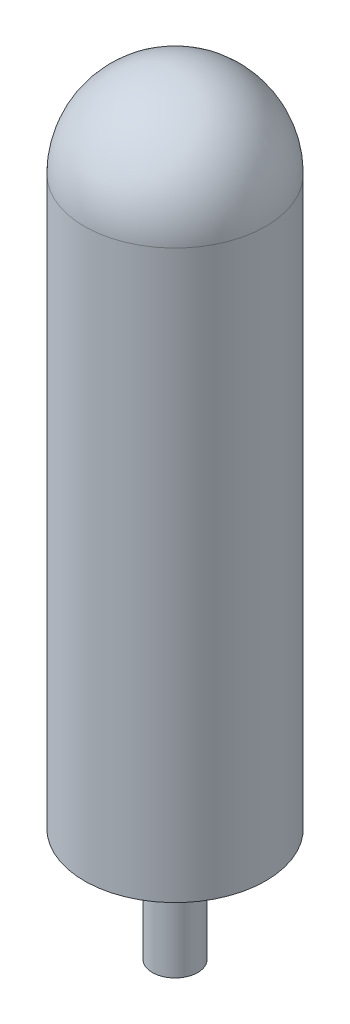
ISO-10303-21;
HEADER;
FILE_DESCRIPTION(('STEP AP214'),'2;1');
FILE_NAME('part.step','',(''),(''),'','','');
FILE_SCHEMA(('AUTOMOTIVE_DESIGN { 1 0 10303 214 1 1 1 1 }'));
ENDSEC;
DATA;
#1=APPLICATION_CONTEXT('core data for automotive mechanical design processes');
#2=APPLICATION_PROTOCOL_DEFINITION('international standard','automotive_design',2000,#1);
#3=PRODUCT_CONTEXT('',#1,'mechanical');
#4=PRODUCT('Part','Part','',(#3));
#5=PRODUCT_RELATED_PRODUCT_CATEGORY('part','',(#4));
#6=PRODUCT_DEFINITION_FORMATION('','',#4);
#7=PRODUCT_DEFINITION_CONTEXT('part definition',#1,'design');
#8=PRODUCT_DEFINITION('design','',#6,#7);
#9=PRODUCT_DEFINITION_SHAPE('','',#8);
#10=(LENGTH_UNIT() NAMED_UNIT(*) SI_UNIT(.MILLI.,.METRE.));
#11=(NAMED_UNIT(*) PLANE_ANGLE_UNIT() SI_UNIT($,.RADIAN.));
#12=(NAMED_UNIT(*) SI_UNIT($,.STERADIAN.) SOLID_ANGLE_UNIT());
#13=UNCERTAINTY_MEASURE_WITH_UNIT(LENGTH_MEASURE(1.E-05),#10,'distance_accuracy_value','');
#14=(GEOMETRIC_REPRESENTATION_CONTEXT(3) GLOBAL_UNCERTAINTY_ASSIGNED_CONTEXT((#13)) GLOBAL_UNIT_ASSIGNED_CONTEXT((#10,
#11,#12)) REPRESENTATION_CONTEXT('',''));
#15=CARTESIAN_POINT('',(0.,0.,0.));
#16=DIRECTION('',(0.,0.,1.));
#17=DIRECTION('',(1.,0.,0.));
#18=AXIS2_PLACEMENT_3D('',#15,#16,#17);
#19=CARTESIAN_POINT('',(0.,0.,0.));
#20=DIRECTION('',(0.,-1.,0.));
#21=DIRECTION('',(1.,0.,0.));
#22=AXIS2_PLACEMENT_3D('',#19,#20,#21);
#23=PLANE('',#22);
#24=CARTESIAN_POINT('',(0.,0.,0.));
#25=DIRECTION('',(0.,-1.,0.));
#26=DIRECTION('',(1.,0.,0.));
#27=AXIS2_PLACEMENT_3D('',#24,#25,#26);
#28=CIRCLE('',#27,2.);
#29=CARTESIAN_POINT('',(2.,0.,0.));
#30=VERTEX_POINT('',#29);
#31=EDGE_CURVE('E10',#30,#30,#28,.T.);
#32=ORIENTED_EDGE('',*,*,#31,.T.);
#33=EDGE_LOOP('',(#32));
#34=FACE_BOUND('',#33,.T.);
#35=ADVANCED_FACE('F37',(#34),#23,.T.);
#36=CARTESIAN_POINT('',(0.,0.,0.));
#37=DIRECTION('',(0.,-1.,0.));
#38=DIRECTION('',(1.,0.,0.));
#39=AXIS2_PLACEMENT_3D('',#36,#37,#38);
#40=CYLINDRICAL_SURFACE('',#39,2.);
#41=CARTESIAN_POINT('',(0.,10.,0.));
#42=DIRECTION('',(0.,-1.,0.));
#43=DIRECTION('',(1.,0.,0.));
#44=AXIS2_PLACEMENT_3D('',#41,#42,#43);
#45=CIRCLE('',#44,2.);
#46=CARTESIAN_POINT('',(2.,10.,0.));
#47=VERTEX_POINT('',#46);
#48=EDGE_CURVE('E44',#47,#47,#45,.T.);
#49=ORIENTED_EDGE('',*,*,#48,.T.);
#50=EDGE_LOOP('',(#49));
#51=FACE_BOUND('',#50,.T.);
#52=ORIENTED_EDGE('',*,*,#31,.F.);
#53=EDGE_LOOP('',(#52));
#54=FACE_BOUND('',#53,.T.);
#55=ADVANCED_FACE('F73',(#51,#54),#40,.T.);
#56=CARTESIAN_POINT('',(2.,10.,0.));
#57=DIRECTION('',(0.,-1.,0.));
#58=DIRECTION('',(1.,0.,0.));
#59=AXIS2_PLACEMENT_3D('',#56,#57,#58);
#60=PLANE('',#59);
#61=CARTESIAN_POINT('',(0.,10.,0.));
#62=DIRECTION('',(0.,-1.,0.));
#63=DIRECTION('',(1.,0.,0.));
#64=AXIS2_PLACEMENT_3D('',#61,#62,#63);
#65=CIRCLE('',#64,8.);
#66=CARTESIAN_POINT('',(8.,10.,0.));
#67=VERTEX_POINT('',#66);
#68=EDGE_CURVE('E49',#67,#67,#65,.T.);
#69=ORIENTED_EDGE('',*,*,#68,.T.);
#70=EDGE_LOOP('',(#69));
#71=FACE_BOUND('',#70,.T.);
#72=ORIENTED_EDGE('',*,*,#48,.F.);
#73=EDGE_LOOP('',(#72));
#74=FACE_BOUND('',#73,.T.);
#75=ADVANCED_FACE('F70',(#71,#74),#60,.T.);
#76=CARTESIAN_POINT('',(0.,0.,0.));
#77=DIRECTION('',(0.,-1.,0.));
#78=DIRECTION('',(1.,0.,0.));
#79=AXIS2_PLACEMENT_3D('',#76,#77,#78);
#80=CYLINDRICAL_SURFACE('',#79,8.);
#81=CARTESIAN_POINT('',(0.,60.,0.));
#82=DIRECTION('',(0.,-1.,0.));
#83=DIRECTION('',(1.,0.,0.));
#84=AXIS2_PLACEMENT_3D('',#81,#82,#83);
#85=CIRCLE('',#84,8.);
#86=CARTESIAN_POINT('',(8.,60.,0.));
#87=VERTEX_POINT('',#86);
#88=EDGE_CURVE('E54',#87,#87,#85,.T.);
#89=ORIENTED_EDGE('',*,*,#88,.T.);
#90=EDGE_LOOP('',(#89));
#91=FACE_BOUND('',#90,.T.);
#92=ORIENTED_EDGE('',*,*,#68,.F.);
#93=EDGE_LOOP('',(#92));
#94=FACE_BOUND('',#93,.T.);
#95=ADVANCED_FACE('F61',(#91,#94),#80,.T.);
#96=CARTESIAN_POINT('',(0.,60.,0.));
#97=DIRECTION('',(0.,-1.,0.));
#98=DIRECTION('',(1.,0.,0.));
#99=AXIS2_PLACEMENT_3D('',#96,#97,#98);
#100=SPHERICAL_SURFACE('',#99,8.);
#101=ORIENTED_EDGE('',*,*,#88,.F.);
#102=EDGE_LOOP('',(#101));
#103=FACE_BOUND('',#102,.T.);
#104=ADVANCED_FACE('F64',(#103),#100,.T.);
#105=CLOSED_SHELL('',(#35,#55,#75,#95,#104));
#106=MANIFOLD_SOLID_BREP('B2',#105);
#107=ADVANCED_BREP_SHAPE_REPRESENTATION('',(#18,#106),#14);
#108=SHAPE_DEFINITION_REPRESENTATION(#9,#107);
ENDSEC;
END-ISO-10303-21;
